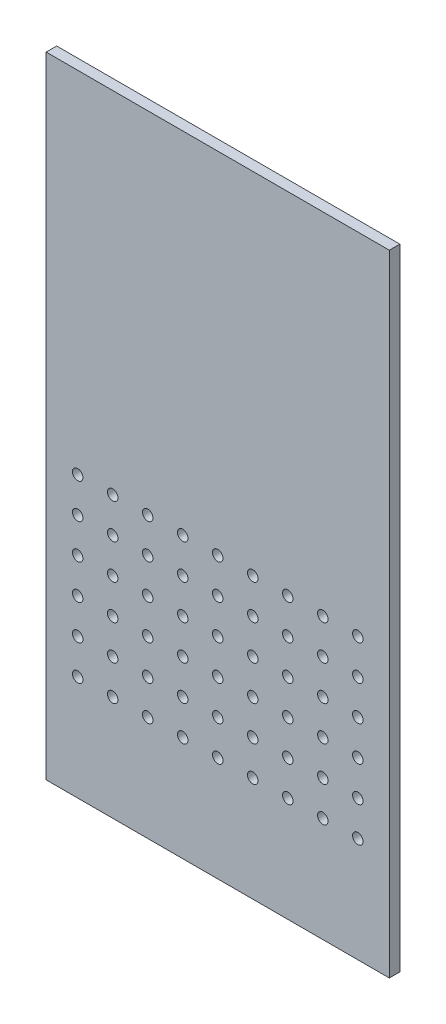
from build123d import *

# Parameters (mm, degrees)
CROQUIS1_W              = 98
CROQUIS1_H              = 180
CROQUIS1_R              = 1.5
SALIENTE_EXTRUIR1_DEPTH = 3


with BuildPart() as part:
    # Croquis1 → Saliente-Extruir1 (new body)
    with BuildSketch(Plane.XY):
        with Locations((4.551303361, 15.533185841)):
            Rectangle(CROQUIS1_W, CROQUIS1_H)
        with Locations((-35.448696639, -24.466814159)):
            Circle(CROQUIS1_R, mode=Mode.SUBTRACT)
        with Locations((-25.448696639, -24.466814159)):
            Circle(CROQUIS1_R, mode=Mode.SUBTRACT)
        with Locations((-15.448696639, -24.466814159)):
            Circle(CROQUIS1_R, mode=Mode.SUBTRACT)
        with Locations((-5.448696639, -24.466814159)):
            Circle(CROQUIS1_R, mode=Mode.SUBTRACT)
        with Locations((4.551303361, -24.466814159)):
            Circle(CROQUIS1_R, mode=Mode.SUBTRACT)
        with Locations((14.551303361, -24.466814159)):
            Circle(CROQUIS1_R, mode=Mode.SUBTRACT)
        with Locations((24.551303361, -24.466814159)):
            Circle(CROQUIS1_R, mode=Mode.SUBTRACT)
        with Locations((34.551303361, -24.466814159)):
            Circle(CROQUIS1_R, mode=Mode.SUBTRACT)
        with Locations((44.551303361, -24.466814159)):
            Circle(CROQUIS1_R, mode=Mode.SUBTRACT)
        with Locations((-25.448696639, -34.466814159)):
            Circle(CROQUIS1_R, mode=Mode.SUBTRACT)
        with Locations((-15.448696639, -34.466814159)):
            Circle(CROQUIS1_R, mode=Mode.SUBTRACT)
        with Locations((-5.448696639, -34.466814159)):
            Circle(CROQUIS1_R, mode=Mode.SUBTRACT)
        with Locations((4.551303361, -34.466814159)):
            Circle(CROQUIS1_R, mode=Mode.SUBTRACT)
        with Locations((14.551303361, -34.466814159)):
            Circle(CROQUIS1_R, mode=Mode.SUBTRACT)
        with Locations((24.551303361, -34.466814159)):
            Circle(CROQUIS1_R, mode=Mode.SUBTRACT)
        with Locations((34.551303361, -34.466814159)):
            Circle(CROQUIS1_R, mode=Mode.SUBTRACT)
        with Locations((44.551303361, -34.466814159)):
            Circle(CROQUIS1_R, mode=Mode.SUBTRACT)
        with Locations((-25.448696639, -44.466814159)):
            Circle(CROQUIS1_R, mode=Mode.SUBTRACT)
        with Locations((-15.448696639, -44.466814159)):
            Circle(CROQUIS1_R, mode=Mode.SUBTRACT)
        with Locations((-5.448696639, -44.466814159)):
            Circle(CROQUIS1_R, mode=Mode.SUBTRACT)
        with Locations((4.551303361, -44.466814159)):
            Circle(CROQUIS1_R, mode=Mode.SUBTRACT)
        with Locations((14.551303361, -44.466814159)):
            Circle(CROQUIS1_R, mode=Mode.SUBTRACT)
        with Locations((24.551303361, -44.466814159)):
            Circle(CROQUIS1_R, mode=Mode.SUBTRACT)
        with Locations((34.551303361, -44.466814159)):
            Circle(CROQUIS1_R, mode=Mode.SUBTRACT)
        with Locations((44.551303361, -44.466814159)):
            Circle(CROQUIS1_R, mode=Mode.SUBTRACT)
        with Locations((-35.448696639, -14.466814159)):
            Circle(CROQUIS1_R, mode=Mode.SUBTRACT)
        with Locations((-25.448696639, -14.466814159)):
            Circle(CROQUIS1_R, mode=Mode.SUBTRACT)
        with Locations((-15.448696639, -14.466814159)):
            Circle(CROQUIS1_R, mode=Mode.SUBTRACT)
        with Locations((-5.448696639, -14.466814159)):
            Circle(CROQUIS1_R, mode=Mode.SUBTRACT)
        with Locations((4.551303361, -14.466814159)):
            Circle(CROQUIS1_R, mode=Mode.SUBTRACT)
        with Locations((14.551303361, -14.466814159)):
            Circle(CROQUIS1_R, mode=Mode.SUBTRACT)
        with Locations((24.551303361, -14.466814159)):
            Circle(CROQUIS1_R, mode=Mode.SUBTRACT)
        with Locations((34.551303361, -14.466814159)):
            Circle(CROQUIS1_R, mode=Mode.SUBTRACT)
        with Locations((44.551303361, -14.466814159)):
            Circle(CROQUIS1_R, mode=Mode.SUBTRACT)
        with Locations((-25.448696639, -4.466814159)):
            Circle(CROQUIS1_R, mode=Mode.SUBTRACT)
        with Locations((-15.448696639, -4.466814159)):
            Circle(CROQUIS1_R, mode=Mode.SUBTRACT)
        with Locations((-5.448696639, -4.466814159)):
            Circle(CROQUIS1_R, mode=Mode.SUBTRACT)
        with Locations((4.551303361, -4.466814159)):
            Circle(CROQUIS1_R, mode=Mode.SUBTRACT)
        with Locations((14.551303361, -4.466814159)):
            Circle(CROQUIS1_R, mode=Mode.SUBTRACT)
        with Locations((24.551303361, -4.466814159)):
            Circle(CROQUIS1_R, mode=Mode.SUBTRACT)
        with Locations((34.551303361, -4.466814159)):
            Circle(CROQUIS1_R, mode=Mode.SUBTRACT)
        with Locations((-35.448696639, -34.466814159)):
            Circle(CROQUIS1_R, mode=Mode.SUBTRACT)
        with Locations((-35.448696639, -44.466814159)):
            Circle(CROQUIS1_R, mode=Mode.SUBTRACT)
        with Locations((44.551303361, -4.466814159)):
            Circle(CROQUIS1_R, mode=Mode.SUBTRACT)
        with Locations((-25.448696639, 5.533185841)):
            Circle(CROQUIS1_R, mode=Mode.SUBTRACT)
        with Locations((-15.448696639, 5.533185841)):
            Circle(CROQUIS1_R, mode=Mode.SUBTRACT)
        with Locations((-5.448696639, 5.533185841)):
            Circle(CROQUIS1_R, mode=Mode.SUBTRACT)
        with Locations((4.551303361, 5.533185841)):
            Circle(CROQUIS1_R, mode=Mode.SUBTRACT)
        with Locations((14.551303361, 5.533185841)):
            Circle(CROQUIS1_R, mode=Mode.SUBTRACT)
        with Locations((24.551303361, 5.533185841)):
            Circle(CROQUIS1_R, mode=Mode.SUBTRACT)
        with Locations((34.551303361, 5.533185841)):
            Circle(CROQUIS1_R, mode=Mode.SUBTRACT)
        with Locations((44.551303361, 5.533185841)):
            Circle(CROQUIS1_R, mode=Mode.SUBTRACT)
        with Locations((-35.448696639, -4.466814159)):
            Circle(CROQUIS1_R, mode=Mode.SUBTRACT)
        with Locations((-35.448696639, 5.533185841)):
            Circle(CROQUIS1_R, mode=Mode.SUBTRACT)
    extrude(amount=SALIENTE_EXTRUIR1_DEPTH)


solid = part.part
